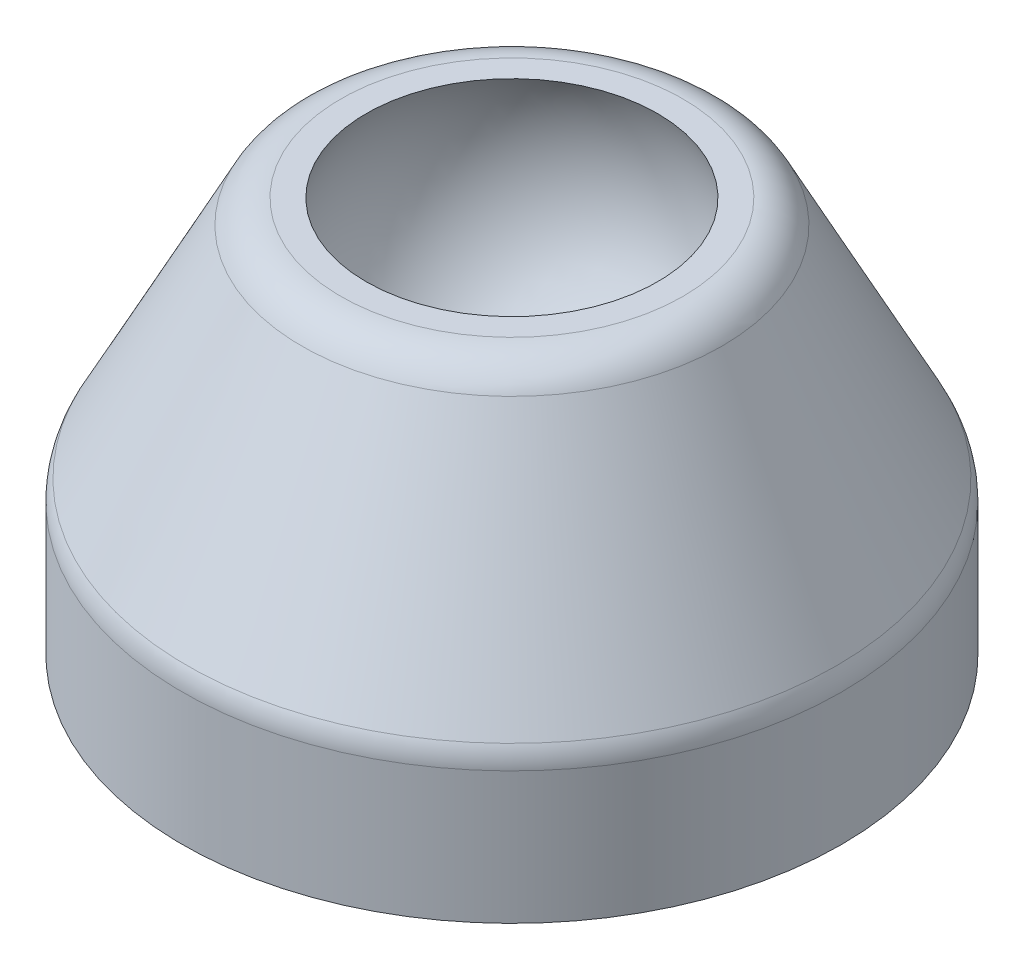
ISO-10303-21;
HEADER;
FILE_DESCRIPTION(('STEP AP214'),'2;1');
FILE_NAME('part.step','',(''),(''),'','','');
FILE_SCHEMA(('AUTOMOTIVE_DESIGN { 1 0 10303 214 1 1 1 1 }'));
ENDSEC;
DATA;
#1=APPLICATION_CONTEXT('core data for automotive mechanical design processes');
#2=APPLICATION_PROTOCOL_DEFINITION('international standard','automotive_design',2000,#1);
#3=PRODUCT_CONTEXT('',#1,'mechanical');
#4=PRODUCT('Part','Part','',(#3));
#5=PRODUCT_RELATED_PRODUCT_CATEGORY('part','',(#4));
#6=PRODUCT_DEFINITION_FORMATION('','',#4);
#7=PRODUCT_DEFINITION_CONTEXT('part definition',#1,'design');
#8=PRODUCT_DEFINITION('design','',#6,#7);
#9=PRODUCT_DEFINITION_SHAPE('','',#8);
#10=(LENGTH_UNIT() NAMED_UNIT(*) SI_UNIT(.MILLI.,.METRE.));
#11=(NAMED_UNIT(*) PLANE_ANGLE_UNIT() SI_UNIT($,.RADIAN.));
#12=(NAMED_UNIT(*) SI_UNIT($,.STERADIAN.) SOLID_ANGLE_UNIT());
#13=UNCERTAINTY_MEASURE_WITH_UNIT(LENGTH_MEASURE(1.E-05),#10,'distance_accuracy_value','');
#14=(GEOMETRIC_REPRESENTATION_CONTEXT(3) GLOBAL_UNCERTAINTY_ASSIGNED_CONTEXT((#13)) GLOBAL_UNIT_ASSIGNED_CONTEXT((#10,
#11,#12)) REPRESENTATION_CONTEXT('',''));
#15=CARTESIAN_POINT('',(0.,0.,0.));
#16=DIRECTION('',(0.,0.,1.));
#17=DIRECTION('',(1.,0.,0.));
#18=AXIS2_PLACEMENT_3D('',#15,#16,#17);
#19=CARTESIAN_POINT('',(0.,0.999999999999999,0.));
#20=DIRECTION('',(0.,1.,0.));
#21=DIRECTION('',(0.,0.,1.));
#22=AXIS2_PLACEMENT_3D('',#19,#20,#21);
#23=PLANE('',#22);
#24=CARTESIAN_POINT('',(0.,0.999999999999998,0.));
#25=DIRECTION('',(0.,1.,0.));
#26=DIRECTION('',(-1.,0.,0.));
#27=AXIS2_PLACEMENT_3D('',#24,#25,#26);
#28=CIRCLE('',#27,7.5);
#29=CARTESIAN_POINT('',(-7.5,0.999999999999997,0.));
#30=VERTEX_POINT('',#29);
#31=EDGE_CURVE('E18',#30,#30,#28,.T.);
#32=ORIENTED_EDGE('',*,*,#31,.F.);
#33=EDGE_LOOP('',(#32));
#34=FACE_BOUND('',#33,.T.);
#35=ADVANCED_FACE('F14',(#34),#23,.F.);
#36=CARTESIAN_POINT('',(0.,0.,0.));
#37=DIRECTION('',(0.,1.,0.));
#38=DIRECTION('',(-1.,0.,0.));
#39=AXIS2_PLACEMENT_3D('',#36,#37,#38);
#40=CYLINDRICAL_SURFACE('',#39,7.5);
#41=CARTESIAN_POINT('',(0.,5.,0.));
#42=DIRECTION('',(0.,1.,0.));
#43=DIRECTION('',(-1.,0.,0.));
#44=AXIS2_PLACEMENT_3D('',#41,#42,#43);
#45=CIRCLE('',#44,7.5);
#46=CARTESIAN_POINT('',(-7.5,5.,0.));
#47=VERTEX_POINT('',#46);
#48=EDGE_CURVE('E72',#47,#47,#45,.F.);
#49=ORIENTED_EDGE('',*,*,#48,.T.);
#50=EDGE_LOOP('',(#49));
#51=FACE_BOUND('',#50,.T.);
#52=ORIENTED_EDGE('',*,*,#31,.T.);
#53=EDGE_LOOP('',(#52));
#54=FACE_BOUND('',#53,.T.);
#55=ADVANCED_FACE('F79',(#51,#54),#40,.T.);
#56=CARTESIAN_POINT('',(0.,5.,0.));
#57=DIRECTION('',(0.,1.,0.));
#58=DIRECTION('',(0.,0.,1.));
#59=AXIS2_PLACEMENT_3D('',#56,#57,#58);
#60=PLANE('',#59);
#61=ORIENTED_EDGE('',*,*,#48,.F.);
#62=EDGE_LOOP('',(#61));
#63=FACE_BOUND('',#62,.T.);
#64=CARTESIAN_POINT('',(0.,5.,0.));
#65=DIRECTION('',(0.,1.,0.));
#66=DIRECTION('',(0.,0.,1.));
#67=AXIS2_PLACEMENT_3D('',#64,#65,#66);
#68=CIRCLE('',#67,11.);
#69=CARTESIAN_POINT('',(0.,5.,11.));
#70=VERTEX_POINT('',#69);
#71=EDGE_CURVE('E70',#70,#70,#68,.F.);
#72=ORIENTED_EDGE('',*,*,#71,.T.);
#73=EDGE_LOOP('',(#72));
#74=FACE_BOUND('',#73,.T.);
#75=ADVANCED_FACE('F86',(#63,#74),#60,.F.);
#76=CARTESIAN_POINT('',(0.,0.,0.));
#77=DIRECTION('',(0.,1.,0.));
#78=DIRECTION('',(0.,0.,1.));
#79=AXIS2_PLACEMENT_3D('',#76,#77,#78);
#80=CYLINDRICAL_SURFACE('',#79,11.);
#81=CARTESIAN_POINT('',(0.,0.,0.));
#82=DIRECTION('',(0.,1.,0.));
#83=DIRECTION('',(0.,0.,1.));
#84=AXIS2_PLACEMENT_3D('',#81,#82,#83);
#85=CIRCLE('',#84,11.);
#86=CARTESIAN_POINT('',(0.,0.,11.));
#87=VERTEX_POINT('',#86);
#88=EDGE_CURVE('E67',#87,#87,#85,.T.);
#89=ORIENTED_EDGE('',*,*,#88,.F.);
#90=EDGE_LOOP('',(#89));
#91=FACE_BOUND('',#90,.T.);
#92=ORIENTED_EDGE('',*,*,#71,.F.);
#93=EDGE_LOOP('',(#92));
#94=FACE_BOUND('',#93,.T.);
#95=ADVANCED_FACE('F122',(#91,#94),#80,.F.);
#96=CARTESIAN_POINT('',(7.5,0.,0.));
#97=DIRECTION('',(0.,-1.,0.));
#98=DIRECTION('',(0.,0.,-1.));
#99=AXIS2_PLACEMENT_3D('',#96,#97,#98);
#100=PLANE('',#99);
#101=ORIENTED_EDGE('',*,*,#88,.T.);
#102=EDGE_LOOP('',(#101));
#103=FACE_BOUND('',#102,.T.);
#104=CARTESIAN_POINT('',(0.,0.,0.));
#105=DIRECTION('',(0.,-1.,0.));
#106=DIRECTION('',(1.,0.,0.));
#107=AXIS2_PLACEMENT_3D('',#104,#105,#106);
#108=CIRCLE('',#107,15.);
#109=CARTESIAN_POINT('',(15.,0.,0.));
#110=VERTEX_POINT('',#109);
#111=EDGE_CURVE('E64',#110,#110,#108,.F.);
#112=ORIENTED_EDGE('',*,*,#111,.F.);
#113=EDGE_LOOP('',(#112));
#114=FACE_BOUND('',#113,.T.);
#115=ADVANCED_FACE('F119',(#103,#114),#100,.T.);
#116=CARTESIAN_POINT('',(0.,14.5,0.));
#117=DIRECTION('',(0.,0.,1.));
#118=DIRECTION('',(1.,0.,0.));
#119=AXIS2_PLACEMENT_3D('',#116,#117,#118);
#120=SPHERICAL_SURFACE('',#119,7.5);
#121=CARTESIAN_POINT('',(0.,14.5,0.));
#122=DIRECTION('',(0.,1.,0.));
#123=DIRECTION('',(0.,0.,1.));
#124=AXIS2_PLACEMENT_3D('',#121,#122,#123);
#125=SPHERICAL_SURFACE('',#124,7.5);
#126=CARTESIAN_POINT('',(0.,18.,0.));
#127=DIRECTION('',(0.,1.,0.));
#128=DIRECTION('',(0.,0.,1.));
#129=AXIS2_PLACEMENT_3D('',#126,#127,#128);
#130=CIRCLE('',#129,6.6332495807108);
#131=CARTESIAN_POINT('',(0.,18.,6.6332495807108));
#132=VERTEX_POINT('',#131);
#133=EDGE_CURVE('E55',#132,#132,#130,.F.);
#134=ORIENTED_EDGE('',*,*,#133,.F.);
#135=EDGE_LOOP('',(#134));
#136=FACE_BOUND('',#135,.T.);
#137=ADVANCED_FACE('F16',(#136),#125,.F.);
#138=CARTESIAN_POINT('',(0.,3.00481303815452,0.));
#139=DIRECTION('',(0.,-1.,0.));
#140=DIRECTION('',(1.,0.,0.));
#141=AXIS2_PLACEMENT_3D('',#138,#139,#140);
#142=CYLINDRICAL_SURFACE('',#141,15.);
#143=CARTESIAN_POINT('',(0.,6.00962607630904,0.));
#144=DIRECTION('',(0.,-1.,0.));
#145=DIRECTION('',(0.,0.,-1.));
#146=AXIS2_PLACEMENT_3D('',#143,#144,#145);
#147=CIRCLE('',#146,15.);
#148=CARTESIAN_POINT('',(0.,6.00962607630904,-15.));
#149=VERTEX_POINT('',#148);
#150=EDGE_CURVE('E63',#149,#149,#147,.F.);
#151=ORIENTED_EDGE('',*,*,#150,.F.);
#152=EDGE_LOOP('',(#151));
#153=FACE_BOUND('',#152,.T.);
#154=ORIENTED_EDGE('',*,*,#111,.T.);
#155=EDGE_LOOP('',(#154));
#156=FACE_BOUND('',#155,.T.);
#157=ADVANCED_FACE('F115',(#153,#156),#142,.T.);
#158=CARTESIAN_POINT('',(7.21044028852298,18.,0.));
#159=DIRECTION('',(0.,1.,0.));
#160=DIRECTION('',(0.,0.,1.));
#161=AXIS2_PLACEMENT_3D('',#158,#159,#160);
#162=PLANE('',#161);
#163=ORIENTED_EDGE('',*,*,#133,.T.);
#164=EDGE_LOOP('',(#163));
#165=FACE_BOUND('',#164,.T.);
#166=CARTESIAN_POINT('',(0.,18.,0.));
#167=DIRECTION('',(0.,-1.,0.));
#168=DIRECTION('',(1.,0.,0.));
#169=AXIS2_PLACEMENT_3D('',#166,#167,#168);
#170=CIRCLE('',#169,7.78763099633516);
#171=CARTESIAN_POINT('',(7.78763099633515,18.,0.));
#172=VERTEX_POINT('',#171);
#173=EDGE_CURVE('E27',#172,#172,#170,.T.);
#174=ORIENTED_EDGE('',*,*,#173,.F.);
#175=EDGE_LOOP('',(#174));
#176=FACE_BOUND('',#175,.T.);
#177=ADVANCED_FACE('F96',(#165,#176),#162,.T.);
#178=CARTESIAN_POINT('',(0.,6.00962607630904,0.));
#179=DIRECTION('',(0.,-1.,0.));
#180=DIRECTION('',(0.,0.,-1.));
#181=AXIS2_PLACEMENT_3D('',#178,#179,#180);
#182=TOROIDAL_SURFACE('',#181,13.,2.);
#183=CARTESIAN_POINT('',(0.,6.934758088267,0.));
#184=DIRECTION('',(0.,-1.,0.));
#185=DIRECTION('',(1.,0.,0.));
#186=AXIS2_PLACEMENT_3D('',#183,#184,#185);
#187=CIRCLE('',#186,14.7731696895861);
#188=CARTESIAN_POINT('',(14.7731696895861,6.934758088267,0.));
#189=VERTEX_POINT('',#188);
#190=EDGE_CURVE('E22',#189,#189,#187,.F.);
#191=ORIENTED_EDGE('',*,*,#190,.F.);
#192=EDGE_LOOP('',(#191));
#193=FACE_BOUND('',#192,.T.);
#194=ORIENTED_EDGE('',*,*,#150,.T.);
#195=EDGE_LOOP('',(#194));
#196=FACE_BOUND('',#195,.T.);
#197=ADVANCED_FACE('F45',(#193,#196),#182,.T.);
#198=CARTESIAN_POINT('',(0.,16.,0.));
#199=DIRECTION('',(0.,-1.,0.));
#200=DIRECTION('',(0.,0.,-1.));
#201=AXIS2_PLACEMENT_3D('',#198,#199,#200);
#202=TOROIDAL_SURFACE('',#201,7.78763099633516,2.);
#203=ORIENTED_EDGE('',*,*,#173,.T.);
#204=EDGE_LOOP('',(#203));
#205=FACE_BOUND('',#204,.T.);
#206=CARTESIAN_POINT('',(0.,16.9251320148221,0.));
#207=DIRECTION('',(0.,-1.,0.));
#208=DIRECTION('',(1.,0.,0.));
#209=AXIS2_PLACEMENT_3D('',#206,#207,#208);
#210=CIRCLE('',#209,9.56080069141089);
#211=CARTESIAN_POINT('',(9.56080069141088,16.9251320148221,0.));
#212=VERTEX_POINT('',#211);
#213=EDGE_CURVE('E10',#212,#212,#210,.T.);
#214=ORIENTED_EDGE('',*,*,#213,.F.);
#215=EDGE_LOOP('',(#214));
#216=FACE_BOUND('',#215,.T.);
#217=ADVANCED_FACE('F39',(#205,#216),#202,.T.);
#218=CARTESIAN_POINT('',(0.,6.934758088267,0.));
#219=DIRECTION('',(0.,-1.,0.));
#220=DIRECTION('',(1.,0.,0.));
#221=AXIS2_PLACEMENT_3D('',#218,#219,#220);
#222=CONICAL_SURFACE('',#221,14.7731696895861,0.480887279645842);
#223=ORIENTED_EDGE('',*,*,#213,.T.);
#224=EDGE_LOOP('',(#223));
#225=FACE_BOUND('',#224,.T.);
#226=ORIENTED_EDGE('',*,*,#190,.T.);
#227=EDGE_LOOP('',(#226));
#228=FACE_BOUND('',#227,.T.);
#229=ADVANCED_FACE('F44',(#225,#228),#222,.T.);
#230=CLOSED_SHELL('',(#35,#55,#75,#95,#115,#137,#157,#177,#197,#217,#229));
#231=MANIFOLD_SOLID_BREP('B1',#230);
#232=ADVANCED_BREP_SHAPE_REPRESENTATION('',(#18,#231),#14);
#233=SHAPE_DEFINITION_REPRESENTATION(#9,#232);
ENDSEC;
END-ISO-10303-21;
